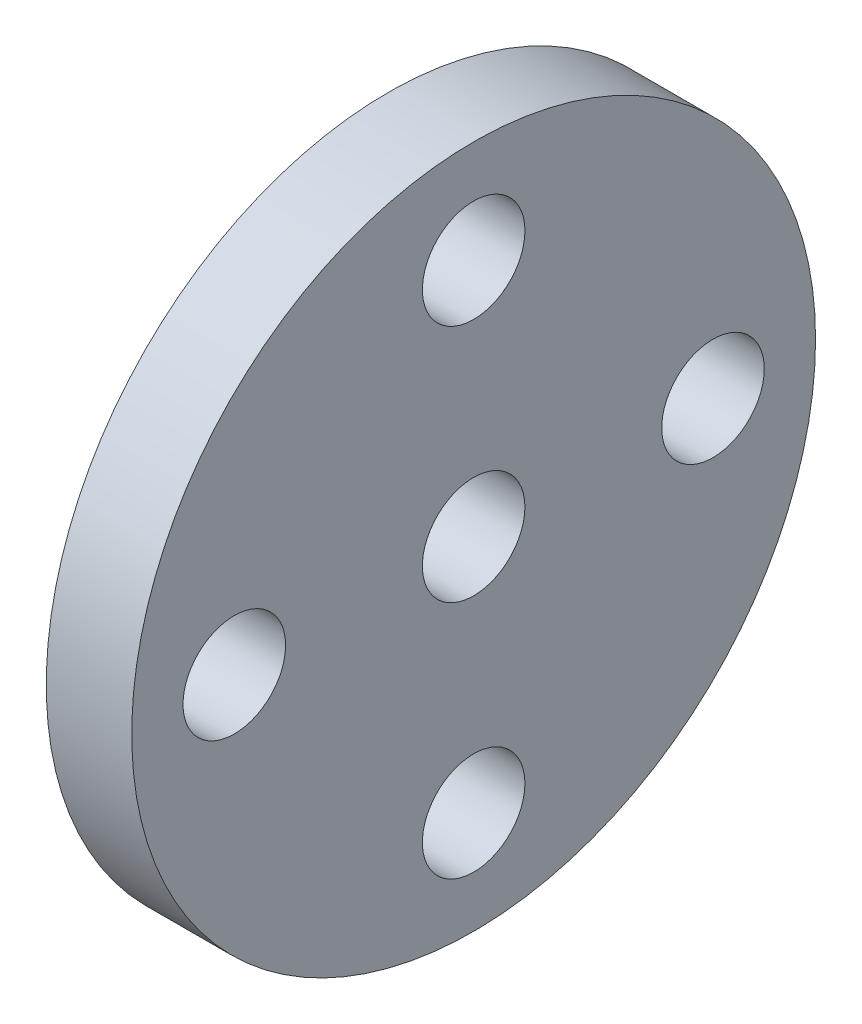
ISO-10303-21;
HEADER;
FILE_DESCRIPTION(('STEP AP214'),'2;1');
FILE_NAME('part.step','',(''),(''),'','','');
FILE_SCHEMA(('AUTOMOTIVE_DESIGN { 1 0 10303 214 1 1 1 1 }'));
ENDSEC;
DATA;
#1=APPLICATION_CONTEXT('core data for automotive mechanical design processes');
#2=APPLICATION_PROTOCOL_DEFINITION('international standard','automotive_design',2000,#1);
#3=PRODUCT_CONTEXT('',#1,'mechanical');
#4=PRODUCT('Part','Part','',(#3));
#5=PRODUCT_RELATED_PRODUCT_CATEGORY('part','',(#4));
#6=PRODUCT_DEFINITION_FORMATION('','',#4);
#7=PRODUCT_DEFINITION_CONTEXT('part definition',#1,'design');
#8=PRODUCT_DEFINITION('design','',#6,#7);
#9=PRODUCT_DEFINITION_SHAPE('','',#8);
#10=(LENGTH_UNIT() NAMED_UNIT(*) SI_UNIT(.MILLI.,.METRE.));
#11=(NAMED_UNIT(*) PLANE_ANGLE_UNIT() SI_UNIT($,.RADIAN.));
#12=(NAMED_UNIT(*) SI_UNIT($,.STERADIAN.) SOLID_ANGLE_UNIT());
#13=UNCERTAINTY_MEASURE_WITH_UNIT(LENGTH_MEASURE(1.E-05),#10,'distance_accuracy_value','');
#14=(GEOMETRIC_REPRESENTATION_CONTEXT(3) GLOBAL_UNCERTAINTY_ASSIGNED_CONTEXT((#13)) GLOBAL_UNIT_ASSIGNED_CONTEXT((#10,
#11,#12)) REPRESENTATION_CONTEXT('',''));
#15=CARTESIAN_POINT('',(0.,0.,0.));
#16=DIRECTION('',(0.,0.,1.));
#17=DIRECTION('',(1.,0.,0.));
#18=AXIS2_PLACEMENT_3D('',#15,#16,#17);
#19=CARTESIAN_POINT('',(0.,0.,-2.44929359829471E-11));
#20=DIRECTION('',(1.,0.,0.));
#21=DIRECTION('',(0.,0.,-1.));
#22=AXIS2_PLACEMENT_3D('',#19,#20,#21);
#23=PLANE('',#22);
#24=CARTESIAN_POINT('',(0.,0.,-2.44929359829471E-11));
#25=DIRECTION('',(1.,0.,0.));
#26=DIRECTION('',(0.,0.,-1.));
#27=AXIS2_PLACEMENT_3D('',#24,#25,#26);
#28=CIRCLE('',#27,1.49999999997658);
#29=CARTESIAN_POINT('',(0.,0.,-1.50000000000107));
#30=VERTEX_POINT('',#29);
#31=EDGE_CURVE('E65',#30,#30,#28,.T.);
#32=ORIENTED_EDGE('',*,*,#31,.T.);
#33=EDGE_LOOP('',(#32));
#34=FACE_BOUND('',#33,.T.);
#35=CARTESIAN_POINT('',(0.,0.,0.));
#36=DIRECTION('',(1.,0.,0.));
#37=DIRECTION('',(0.,0.,-1.));
#38=AXIS2_PLACEMENT_3D('',#35,#36,#37);
#39=CIRCLE('',#38,3.);
#40=CARTESIAN_POINT('',(0.,0.,-3.));
#41=VERTEX_POINT('',#40);
#42=EDGE_CURVE('E10',#41,#41,#39,.T.);
#43=ORIENTED_EDGE('',*,*,#42,.F.);
#44=EDGE_LOOP('',(#43));
#45=FACE_BOUND('',#44,.T.);
#46=ADVANCED_FACE('F35',(#34,#45),#23,.F.);
#47=CARTESIAN_POINT('',(2.5,0.,-2.44929359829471E-11));
#48=DIRECTION('',(1.,0.,0.));
#49=DIRECTION('',(0.,0.,-1.));
#50=AXIS2_PLACEMENT_3D('',#47,#48,#49);
#51=PLANE('',#50);
#52=CARTESIAN_POINT('',(2.5,-7.,0.));
#53=DIRECTION('',(1.,0.,0.));
#54=DIRECTION('',(0.,0.,-1.));
#55=AXIS2_PLACEMENT_3D('',#52,#53,#54);
#56=CIRCLE('',#55,1.5);
#57=CARTESIAN_POINT('',(2.5,-7.,-1.5));
#58=VERTEX_POINT('',#57);
#59=EDGE_CURVE('E68',#58,#58,#56,.T.);
#60=ORIENTED_EDGE('',*,*,#59,.F.);
#61=EDGE_LOOP('',(#60));
#62=FACE_BOUND('',#61,.T.);
#63=CARTESIAN_POINT('',(2.5,0.,6.99999999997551));
#64=DIRECTION('',(1.,0.,0.));
#65=DIRECTION('',(0.,0.,-1.));
#66=AXIS2_PLACEMENT_3D('',#63,#64,#65);
#67=CIRCLE('',#66,1.5);
#68=CARTESIAN_POINT('',(2.5,0.,5.49999999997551));
#69=VERTEX_POINT('',#68);
#70=EDGE_CURVE('E56',#69,#69,#67,.T.);
#71=ORIENTED_EDGE('',*,*,#70,.F.);
#72=EDGE_LOOP('',(#71));
#73=FACE_BOUND('',#72,.T.);
#74=CARTESIAN_POINT('',(2.5,0.,-2.44929359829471E-11));
#75=DIRECTION('',(1.,0.,0.));
#76=DIRECTION('',(0.,0.,-1.));
#77=AXIS2_PLACEMENT_3D('',#74,#75,#76);
#78=CIRCLE('',#77,9.99999999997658);
#79=CARTESIAN_POINT('',(2.5,0.,-10.0000000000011));
#80=VERTEX_POINT('',#79);
#81=EDGE_CURVE('E42',#80,#80,#78,.T.);
#82=ORIENTED_EDGE('',*,*,#81,.T.);
#83=EDGE_LOOP('',(#82));
#84=FACE_BOUND('',#83,.T.);
#85=CARTESIAN_POINT('',(2.5,7.,-0.000723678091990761));
#86=DIRECTION('',(1.,0.,0.));
#87=DIRECTION('',(0.,0.,-1.));
#88=AXIS2_PLACEMENT_3D('',#85,#86,#87);
#89=CIRCLE('',#88,1.5);
#90=CARTESIAN_POINT('',(2.5,7.,-1.50072367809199));
#91=VERTEX_POINT('',#90);
#92=EDGE_CURVE('E51',#91,#91,#89,.T.);
#93=ORIENTED_EDGE('',*,*,#92,.F.);
#94=EDGE_LOOP('',(#93));
#95=FACE_BOUND('',#94,.T.);
#96=CARTESIAN_POINT('',(2.5,0.,-2.44929359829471E-11));
#97=DIRECTION('',(1.,0.,0.));
#98=DIRECTION('',(0.,0.,-1.));
#99=AXIS2_PLACEMENT_3D('',#96,#97,#98);
#100=CIRCLE('',#99,1.49999999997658);
#101=CARTESIAN_POINT('',(2.5,0.,-1.50000000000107));
#102=VERTEX_POINT('',#101);
#103=EDGE_CURVE('E62',#102,#102,#100,.T.);
#104=ORIENTED_EDGE('',*,*,#103,.F.);
#105=EDGE_LOOP('',(#104));
#106=FACE_BOUND('',#105,.T.);
#107=CARTESIAN_POINT('',(2.5,0.,-7.));
#108=DIRECTION('',(1.,0.,0.));
#109=DIRECTION('',(0.,0.,-1.));
#110=AXIS2_PLACEMENT_3D('',#107,#108,#109);
#111=CIRCLE('',#110,1.5);
#112=CARTESIAN_POINT('',(2.5,0.,-8.5));
#113=VERTEX_POINT('',#112);
#114=EDGE_CURVE('E74',#113,#113,#111,.T.);
#115=ORIENTED_EDGE('',*,*,#114,.F.);
#116=EDGE_LOOP('',(#115));
#117=FACE_BOUND('',#116,.T.);
#118=ADVANCED_FACE('F104',(#62,#73,#84,#95,#106,#117),#51,.T.);
#119=CARTESIAN_POINT('',(0.,0.,0.));
#120=DIRECTION('',(1.,0.,0.));
#121=DIRECTION('',(0.,0.,-1.));
#122=AXIS2_PLACEMENT_3D('',#119,#120,#121);
#123=CIRCLE('',#122,4.5);
#124=CARTESIAN_POINT('',(0.,0.,-4.5));
#125=VERTEX_POINT('',#124);
#126=EDGE_CURVE('E83',#125,#125,#123,.T.);
#127=ORIENTED_EDGE('',*,*,#126,.T.);
#128=EDGE_LOOP('',(#127));
#129=FACE_BOUND('',#128,.T.);
#130=CARTESIAN_POINT('',(0.,0.,-2.44929359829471E-11));
#131=DIRECTION('',(1.,0.,0.));
#132=DIRECTION('',(0.,0.,-1.));
#133=AXIS2_PLACEMENT_3D('',#130,#131,#132);
#134=CIRCLE('',#133,9.99999999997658);
#135=CARTESIAN_POINT('',(0.,0.,-10.0000000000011));
#136=VERTEX_POINT('',#135);
#137=EDGE_CURVE('E46',#136,#136,#134,.T.);
#138=ORIENTED_EDGE('',*,*,#137,.F.);
#139=EDGE_LOOP('',(#138));
#140=FACE_BOUND('',#139,.T.);
#141=CARTESIAN_POINT('',(0.,7.,-0.000723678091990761));
#142=DIRECTION('',(1.,0.,0.));
#143=DIRECTION('',(0.,0.,-1.));
#144=AXIS2_PLACEMENT_3D('',#141,#142,#143);
#145=CIRCLE('',#144,1.5);
#146=CARTESIAN_POINT('',(0.,7.,-1.50072367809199));
#147=VERTEX_POINT('',#146);
#148=EDGE_CURVE('E53',#147,#147,#145,.T.);
#149=ORIENTED_EDGE('',*,*,#148,.T.);
#150=EDGE_LOOP('',(#149));
#151=FACE_BOUND('',#150,.T.);
#152=CARTESIAN_POINT('',(0.,0.,6.99999999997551));
#153=DIRECTION('',(1.,0.,0.));
#154=DIRECTION('',(0.,0.,-1.));
#155=AXIS2_PLACEMENT_3D('',#152,#153,#154);
#156=CIRCLE('',#155,1.5);
#157=CARTESIAN_POINT('',(0.,0.,5.49999999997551));
#158=VERTEX_POINT('',#157);
#159=EDGE_CURVE('E59',#158,#158,#156,.T.);
#160=ORIENTED_EDGE('',*,*,#159,.T.);
#161=EDGE_LOOP('',(#160));
#162=FACE_BOUND('',#161,.T.);
#163=CARTESIAN_POINT('',(0.,-7.,0.));
#164=DIRECTION('',(1.,0.,0.));
#165=DIRECTION('',(0.,0.,-1.));
#166=AXIS2_PLACEMENT_3D('',#163,#164,#165);
#167=CIRCLE('',#166,1.5);
#168=CARTESIAN_POINT('',(0.,-7.,-1.5));
#169=VERTEX_POINT('',#168);
#170=EDGE_CURVE('E71',#169,#169,#167,.T.);
#171=ORIENTED_EDGE('',*,*,#170,.T.);
#172=EDGE_LOOP('',(#171));
#173=FACE_BOUND('',#172,.T.);
#174=CARTESIAN_POINT('',(0.,0.,-7.));
#175=DIRECTION('',(1.,0.,0.));
#176=DIRECTION('',(0.,0.,-1.));
#177=AXIS2_PLACEMENT_3D('',#174,#175,#176);
#178=CIRCLE('',#177,1.5);
#179=CARTESIAN_POINT('',(0.,0.,-8.5));
#180=VERTEX_POINT('',#179);
#181=EDGE_CURVE('E77',#180,#180,#178,.T.);
#182=ORIENTED_EDGE('',*,*,#181,.T.);
#183=EDGE_LOOP('',(#182));
#184=FACE_BOUND('',#183,.T.);
#185=ADVANCED_FACE('F106',(#129,#140,#151,#162,#173,#184),#23,.F.);
#186=CARTESIAN_POINT('',(2.5,0.,-2.44929359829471E-11));
#187=DIRECTION('',(-1.,0.,0.));
#188=DIRECTION('',(0.,0.,1.));
#189=AXIS2_PLACEMENT_3D('',#186,#187,#188);
#190=CYLINDRICAL_SURFACE('',#189,9.99999999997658);
#191=ORIENTED_EDGE('',*,*,#81,.F.);
#192=EDGE_LOOP('',(#191));
#193=FACE_BOUND('',#192,.T.);
#194=ORIENTED_EDGE('',*,*,#137,.T.);
#195=EDGE_LOOP('',(#194));
#196=FACE_BOUND('',#195,.T.);
#197=ADVANCED_FACE('F37',(#193,#196),#190,.T.);
#198=CARTESIAN_POINT('',(2.5,7.,-0.000723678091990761));
#199=DIRECTION('',(-1.,0.,0.));
#200=DIRECTION('',(0.,0.,1.));
#201=AXIS2_PLACEMENT_3D('',#198,#199,#200);
#202=CYLINDRICAL_SURFACE('',#201,1.5);
#203=ORIENTED_EDGE('',*,*,#92,.T.);
#204=EDGE_LOOP('',(#203));
#205=FACE_BOUND('',#204,.T.);
#206=ORIENTED_EDGE('',*,*,#148,.F.);
#207=EDGE_LOOP('',(#206));
#208=FACE_BOUND('',#207,.T.);
#209=ADVANCED_FACE('F118',(#205,#208),#202,.F.);
#210=CARTESIAN_POINT('',(2.5,0.,6.99999999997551));
#211=DIRECTION('',(-1.,0.,0.));
#212=DIRECTION('',(0.,0.,1.));
#213=AXIS2_PLACEMENT_3D('',#210,#211,#212);
#214=CYLINDRICAL_SURFACE('',#213,1.5);
#215=ORIENTED_EDGE('',*,*,#70,.T.);
#216=EDGE_LOOP('',(#215));
#217=FACE_BOUND('',#216,.T.);
#218=ORIENTED_EDGE('',*,*,#159,.F.);
#219=EDGE_LOOP('',(#218));
#220=FACE_BOUND('',#219,.T.);
#221=ADVANCED_FACE('F149',(#217,#220),#214,.F.);
#222=CARTESIAN_POINT('',(2.5,0.,-2.44929359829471E-11));
#223=DIRECTION('',(-1.,0.,0.));
#224=DIRECTION('',(0.,0.,1.));
#225=AXIS2_PLACEMENT_3D('',#222,#223,#224);
#226=CYLINDRICAL_SURFACE('',#225,1.49999999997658);
#227=ORIENTED_EDGE('',*,*,#103,.T.);
#228=EDGE_LOOP('',(#227));
#229=FACE_BOUND('',#228,.T.);
#230=ORIENTED_EDGE('',*,*,#31,.F.);
#231=EDGE_LOOP('',(#230));
#232=FACE_BOUND('',#231,.T.);
#233=ADVANCED_FACE('F143',(#229,#232),#226,.F.);
#234=CARTESIAN_POINT('',(2.5,-7.,0.));
#235=DIRECTION('',(-1.,0.,0.));
#236=DIRECTION('',(0.,0.,1.));
#237=AXIS2_PLACEMENT_3D('',#234,#235,#236);
#238=CYLINDRICAL_SURFACE('',#237,1.5);
#239=ORIENTED_EDGE('',*,*,#59,.T.);
#240=EDGE_LOOP('',(#239));
#241=FACE_BOUND('',#240,.T.);
#242=ORIENTED_EDGE('',*,*,#170,.F.);
#243=EDGE_LOOP('',(#242));
#244=FACE_BOUND('',#243,.T.);
#245=ADVANCED_FACE('F134',(#241,#244),#238,.F.);
#246=CARTESIAN_POINT('',(2.5,0.,-7.));
#247=DIRECTION('',(-1.,0.,0.));
#248=DIRECTION('',(0.,0.,1.));
#249=AXIS2_PLACEMENT_3D('',#246,#247,#248);
#250=CYLINDRICAL_SURFACE('',#249,1.5);
#251=ORIENTED_EDGE('',*,*,#114,.T.);
#252=EDGE_LOOP('',(#251));
#253=FACE_BOUND('',#252,.T.);
#254=ORIENTED_EDGE('',*,*,#181,.F.);
#255=EDGE_LOOP('',(#254));
#256=FACE_BOUND('',#255,.T.);
#257=ADVANCED_FACE('F132',(#253,#256),#250,.F.);
#258=CARTESIAN_POINT('',(-1.5,0.,0.));
#259=DIRECTION('',(1.,0.,0.));
#260=DIRECTION('',(0.,0.,-1.));
#261=AXIS2_PLACEMENT_3D('',#258,#259,#260);
#262=CYLINDRICAL_SURFACE('',#261,4.5);
#263=CARTESIAN_POINT('',(-1.5,0.,0.));
#264=DIRECTION('',(1.,0.,0.));
#265=DIRECTION('',(0.,0.,-1.));
#266=AXIS2_PLACEMENT_3D('',#263,#264,#265);
#267=CIRCLE('',#266,4.5);
#268=CARTESIAN_POINT('',(-1.5,0.,-4.5));
#269=VERTEX_POINT('',#268);
#270=EDGE_CURVE('E80',#269,#269,#267,.T.);
#271=ORIENTED_EDGE('',*,*,#270,.T.);
#272=EDGE_LOOP('',(#271));
#273=FACE_BOUND('',#272,.T.);
#274=ORIENTED_EDGE('',*,*,#126,.F.);
#275=EDGE_LOOP('',(#274));
#276=FACE_BOUND('',#275,.T.);
#277=ADVANCED_FACE('F101',(#273,#276),#262,.T.);
#278=CARTESIAN_POINT('',(-1.5,0.,0.));
#279=DIRECTION('',(1.,0.,0.));
#280=DIRECTION('',(0.,0.,-1.));
#281=AXIS2_PLACEMENT_3D('',#278,#279,#280);
#282=PLANE('',#281);
#283=CARTESIAN_POINT('',(-1.5,0.,0.));
#284=DIRECTION('',(1.,0.,0.));
#285=DIRECTION('',(0.,0.,-1.));
#286=AXIS2_PLACEMENT_3D('',#283,#284,#285);
#287=CIRCLE('',#286,3.);
#288=CARTESIAN_POINT('',(-1.5,0.,-3.));
#289=VERTEX_POINT('',#288);
#290=EDGE_CURVE('E86',#289,#289,#287,.T.);
#291=ORIENTED_EDGE('',*,*,#290,.T.);
#292=EDGE_LOOP('',(#291));
#293=FACE_BOUND('',#292,.T.);
#294=ORIENTED_EDGE('',*,*,#270,.F.);
#295=EDGE_LOOP('',(#294));
#296=FACE_BOUND('',#295,.T.);
#297=ADVANCED_FACE('F92',(#293,#296),#282,.F.);
#298=CARTESIAN_POINT('',(-1.5,0.,0.));
#299=DIRECTION('',(1.,0.,0.));
#300=DIRECTION('',(0.,0.,-1.));
#301=AXIS2_PLACEMENT_3D('',#298,#299,#300);
#302=CYLINDRICAL_SURFACE('',#301,3.);
#303=ORIENTED_EDGE('',*,*,#290,.F.);
#304=EDGE_LOOP('',(#303));
#305=FACE_BOUND('',#304,.T.);
#306=ORIENTED_EDGE('',*,*,#42,.T.);
#307=EDGE_LOOP('',(#306));
#308=FACE_BOUND('',#307,.T.);
#309=ADVANCED_FACE('F95',(#305,#308),#302,.F.);
#310=CLOSED_SHELL('',(#46,#118,#185,#197,#209,#221,#233,#245,#257,#277,#297,#309));
#311=MANIFOLD_SOLID_BREP('B2',#310);
#312=ADVANCED_BREP_SHAPE_REPRESENTATION('',(#18,#311),#14);
#313=SHAPE_DEFINITION_REPRESENTATION(#9,#312);
ENDSEC;
END-ISO-10303-21;
